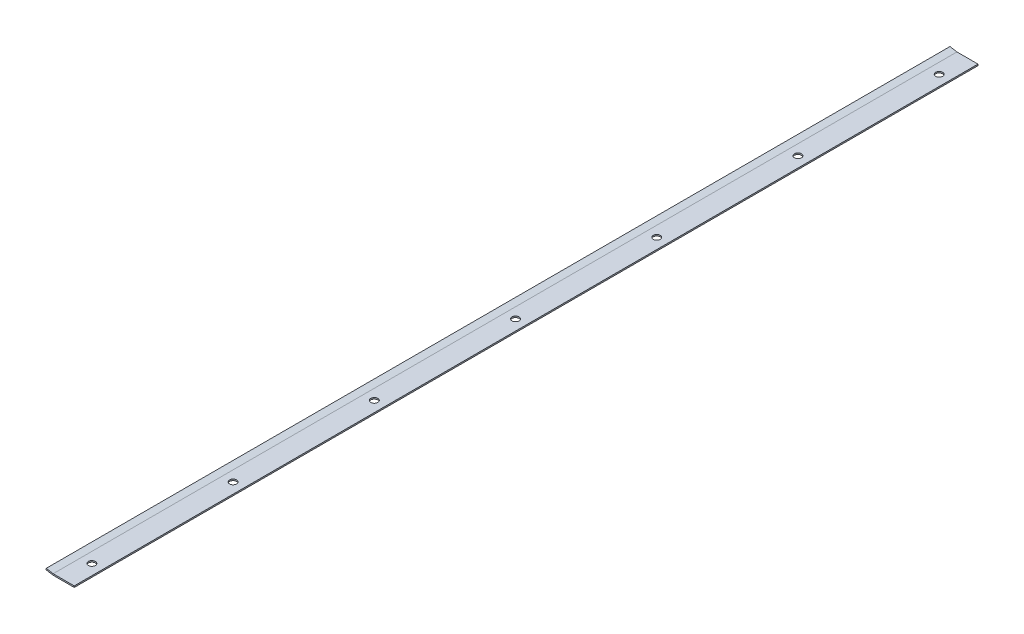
ISO-10303-21;
HEADER;
FILE_DESCRIPTION(('STEP AP214'),'2;1');
FILE_NAME('part.step','',(''),(''),'','','');
FILE_SCHEMA(('AUTOMOTIVE_DESIGN { 1 0 10303 214 1 1 1 1 }'));
ENDSEC;
DATA;
#1=APPLICATION_CONTEXT('core data for automotive mechanical design processes');
#2=APPLICATION_PROTOCOL_DEFINITION('international standard','automotive_design',2000,#1);
#3=PRODUCT_CONTEXT('',#1,'mechanical');
#4=PRODUCT('Part','Part','',(#3));
#5=PRODUCT_RELATED_PRODUCT_CATEGORY('part','',(#4));
#6=PRODUCT_DEFINITION_FORMATION('','',#4);
#7=PRODUCT_DEFINITION_CONTEXT('part definition',#1,'design');
#8=PRODUCT_DEFINITION('design','',#6,#7);
#9=PRODUCT_DEFINITION_SHAPE('','',#8);
#10=(LENGTH_UNIT() NAMED_UNIT(*) SI_UNIT(.MILLI.,.METRE.));
#11=(NAMED_UNIT(*) PLANE_ANGLE_UNIT() SI_UNIT($,.RADIAN.));
#12=(NAMED_UNIT(*) SI_UNIT($,.STERADIAN.) SOLID_ANGLE_UNIT());
#13=UNCERTAINTY_MEASURE_WITH_UNIT(LENGTH_MEASURE(1.E-05),#10,'distance_accuracy_value','');
#14=(GEOMETRIC_REPRESENTATION_CONTEXT(3) GLOBAL_UNCERTAINTY_ASSIGNED_CONTEXT((#13)) GLOBAL_UNIT_ASSIGNED_CONTEXT((#10,
#11,#12)) REPRESENTATION_CONTEXT('',''));
#15=CARTESIAN_POINT('',(0.,0.,0.));
#16=DIRECTION('',(0.,0.,1.));
#17=DIRECTION('',(1.,0.,0.));
#18=AXIS2_PLACEMENT_3D('',#15,#16,#17);
#19=CARTESIAN_POINT('',(0.,0.,320.));
#20=DIRECTION('',(0.,-1.,0.));
#21=DIRECTION('',(0.,0.,-1.));
#22=AXIS2_PLACEMENT_3D('',#19,#20,#21);
#23=PLANE('',#22);
#24=CARTESIAN_POINT('',(-7.50000000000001,0.,300.));
#25=DIRECTION('',(0.,-1.,0.));
#26=DIRECTION('',(0.,0.,-1.));
#27=AXIS2_PLACEMENT_3D('',#24,#25,#26);
#28=CIRCLE('',#27,2.5);
#29=CARTESIAN_POINT('',(-7.50000000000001,0.,297.5));
#30=VERTEX_POINT('',#29);
#31=EDGE_CURVE('E122',#30,#30,#28,.T.);
#32=ORIENTED_EDGE('',*,*,#31,.F.);
#33=EDGE_LOOP('',(#32));
#34=FACE_BOUND('',#33,.T.);
#35=DIRECTION('',(-1.,0.,0.));
#36=VECTOR('',#35,1.);
#37=CARTESIAN_POINT('',(0.,0.,-320.));
#38=LINE('',#37,#36);
#39=CARTESIAN_POINT('',(0.,0.,-320.));
#40=VERTEX_POINT('',#39);
#41=CARTESIAN_POINT('',(-15.,0.,-320.));
#42=VERTEX_POINT('',#41);
#43=EDGE_CURVE('E132',#40,#42,#38,.T.);
#44=ORIENTED_EDGE('',*,*,#43,.F.);
#45=DIRECTION('',(0.,0.,-1.));
#46=VECTOR('',#45,1.);
#47=CARTESIAN_POINT('',(0.,0.,320.));
#48=LINE('',#47,#46);
#49=CARTESIAN_POINT('',(0.,0.,320.));
#50=VERTEX_POINT('',#49);
#51=EDGE_CURVE('E167',#50,#40,#48,.T.);
#52=ORIENTED_EDGE('',*,*,#51,.F.);
#53=DIRECTION('',(-1.,0.,0.));
#54=VECTOR('',#53,1.);
#55=CARTESIAN_POINT('',(0.,0.,320.));
#56=LINE('',#55,#54);
#57=CARTESIAN_POINT('',(-15.,0.,320.));
#58=VERTEX_POINT('',#57);
#59=EDGE_CURVE('E154',#50,#58,#56,.T.);
#60=ORIENTED_EDGE('',*,*,#59,.T.);
#61=DIRECTION('',(0.,0.,-1.));
#62=VECTOR('',#61,1.);
#63=CARTESIAN_POINT('',(-15.,0.,320.));
#64=LINE('',#63,#62);
#65=EDGE_CURVE('E170',#58,#42,#64,.T.);
#66=ORIENTED_EDGE('',*,*,#65,.T.);
#67=EDGE_LOOP('',(#44,#52,#60,#66));
#68=FACE_BOUND('',#67,.T.);
#69=CARTESIAN_POINT('',(-7.50000000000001,0.,200.));
#70=DIRECTION('',(0.,-1.,0.));
#71=DIRECTION('',(0.,0.,-1.));
#72=AXIS2_PLACEMENT_3D('',#69,#70,#71);
#73=CIRCLE('',#72,2.5);
#74=CARTESIAN_POINT('',(-7.50000000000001,0.,197.5));
#75=VERTEX_POINT('',#74);
#76=EDGE_CURVE('E380',#75,#75,#73,.T.);
#77=ORIENTED_EDGE('',*,*,#76,.F.);
#78=EDGE_LOOP('',(#77));
#79=FACE_BOUND('',#78,.T.);
#80=CARTESIAN_POINT('',(-7.50000000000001,0.,100.));
#81=DIRECTION('',(0.,-1.,0.));
#82=DIRECTION('',(0.,0.,-1.));
#83=AXIS2_PLACEMENT_3D('',#80,#81,#82);
#84=CIRCLE('',#83,2.5);
#85=CARTESIAN_POINT('',(-7.50000000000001,0.,97.5000000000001));
#86=VERTEX_POINT('',#85);
#87=EDGE_CURVE('E111',#86,#86,#84,.T.);
#88=ORIENTED_EDGE('',*,*,#87,.F.);
#89=EDGE_LOOP('',(#88));
#90=FACE_BOUND('',#89,.T.);
#91=CARTESIAN_POINT('',(-7.50000000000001,0.,0.));
#92=DIRECTION('',(0.,-1.,0.));
#93=DIRECTION('',(0.,0.,-1.));
#94=AXIS2_PLACEMENT_3D('',#91,#92,#93);
#95=CIRCLE('',#94,2.5);
#96=CARTESIAN_POINT('',(-7.50000000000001,0.,-2.50000000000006));
#97=VERTEX_POINT('',#96);
#98=EDGE_CURVE('E182',#97,#97,#95,.T.);
#99=ORIENTED_EDGE('',*,*,#98,.F.);
#100=EDGE_LOOP('',(#99));
#101=FACE_BOUND('',#100,.T.);
#102=CARTESIAN_POINT('',(-7.50000000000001,0.,-100.));
#103=DIRECTION('',(0.,-1.,0.));
#104=DIRECTION('',(0.,0.,-1.));
#105=AXIS2_PLACEMENT_3D('',#102,#103,#104);
#106=CIRCLE('',#105,2.5);
#107=CARTESIAN_POINT('',(-7.50000000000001,0.,-102.5));
#108=VERTEX_POINT('',#107);
#109=EDGE_CURVE('E190',#108,#108,#106,.T.);
#110=ORIENTED_EDGE('',*,*,#109,.F.);
#111=EDGE_LOOP('',(#110));
#112=FACE_BOUND('',#111,.T.);
#113=CARTESIAN_POINT('',(-7.50000000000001,0.,-200.));
#114=DIRECTION('',(0.,-1.,0.));
#115=DIRECTION('',(0.,0.,-1.));
#116=AXIS2_PLACEMENT_3D('',#113,#114,#115);
#117=CIRCLE('',#116,2.5);
#118=CARTESIAN_POINT('',(-7.50000000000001,0.,-202.5));
#119=VERTEX_POINT('',#118);
#120=EDGE_CURVE('E198',#119,#119,#117,.T.);
#121=ORIENTED_EDGE('',*,*,#120,.F.);
#122=EDGE_LOOP('',(#121));
#123=FACE_BOUND('',#122,.T.);
#124=CARTESIAN_POINT('',(-7.50000000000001,0.,-300.));
#125=DIRECTION('',(0.,-1.,0.));
#126=DIRECTION('',(0.,0.,-1.));
#127=AXIS2_PLACEMENT_3D('',#124,#125,#126);
#128=CIRCLE('',#127,2.5);
#129=CARTESIAN_POINT('',(-7.50000000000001,0.,-302.5));
#130=VERTEX_POINT('',#129);
#131=EDGE_CURVE('E53',#130,#130,#128,.T.);
#132=ORIENTED_EDGE('',*,*,#131,.F.);
#133=EDGE_LOOP('',(#132));
#134=FACE_BOUND('',#133,.T.);
#135=ADVANCED_FACE('F44',(#34,#68,#79,#90,#101,#112,#123,#134),#23,.T.);
#136=CARTESIAN_POINT('',(0.,1.00000000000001,320.));
#137=DIRECTION('',(0.,-1.,0.));
#138=DIRECTION('',(0.,0.,-1.));
#139=AXIS2_PLACEMENT_3D('',#136,#137,#138);
#140=PLANE('',#139);
#141=CARTESIAN_POINT('',(-7.50000000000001,1.00000000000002,300.));
#142=DIRECTION('',(0.,-1.,0.));
#143=DIRECTION('',(0.,0.,-1.));
#144=AXIS2_PLACEMENT_3D('',#141,#142,#143);
#145=CIRCLE('',#144,2.5);
#146=CARTESIAN_POINT('',(-7.50000000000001,1.00000000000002,297.5));
#147=VERTEX_POINT('',#146);
#148=EDGE_CURVE('E400',#147,#147,#145,.T.);
#149=ORIENTED_EDGE('',*,*,#148,.T.);
#150=EDGE_LOOP('',(#149));
#151=FACE_BOUND('',#150,.T.);
#152=DIRECTION('',(-1.,0.,0.));
#153=VECTOR('',#152,1.);
#154=CARTESIAN_POINT('',(0.,1.,-320.));
#155=LINE('',#154,#153);
#156=CARTESIAN_POINT('',(0.,1.,-320.));
#157=VERTEX_POINT('',#156);
#158=CARTESIAN_POINT('',(-14.9125113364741,1.,-320.));
#159=VERTEX_POINT('',#158);
#160=EDGE_CURVE('E142',#157,#159,#155,.T.);
#161=ORIENTED_EDGE('',*,*,#160,.T.);
#162=DIRECTION('',(0.,0.,-1.));
#163=VECTOR('',#162,1.);
#164=CARTESIAN_POINT('',(-14.9125113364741,1.00000000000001,320.));
#165=LINE('',#164,#163);
#166=CARTESIAN_POINT('',(-14.9125113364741,1.00000000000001,320.));
#167=VERTEX_POINT('',#166);
#168=EDGE_CURVE('E118',#167,#159,#165,.T.);
#169=ORIENTED_EDGE('',*,*,#168,.F.);
#170=DIRECTION('',(-1.,0.,0.));
#171=VECTOR('',#170,1.);
#172=CARTESIAN_POINT('',(0.,1.00000000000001,320.));
#173=LINE('',#172,#171);
#174=CARTESIAN_POINT('',(0.,1.00000000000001,320.));
#175=VERTEX_POINT('',#174);
#176=EDGE_CURVE('E60',#175,#167,#173,.T.);
#177=ORIENTED_EDGE('',*,*,#176,.F.);
#178=DIRECTION('',(0.,0.,-1.));
#179=VECTOR('',#178,1.);
#180=CARTESIAN_POINT('',(0.,1.00000000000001,320.));
#181=LINE('',#180,#179);
#182=EDGE_CURVE('E68',#175,#157,#181,.T.);
#183=ORIENTED_EDGE('',*,*,#182,.T.);
#184=EDGE_LOOP('',(#161,#169,#177,#183));
#185=FACE_BOUND('',#184,.T.);
#186=CARTESIAN_POINT('',(-7.50000000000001,1.,200.));
#187=DIRECTION('',(0.,-1.,0.));
#188=DIRECTION('',(0.,0.,-1.));
#189=AXIS2_PLACEMENT_3D('',#186,#187,#188);
#190=CIRCLE('',#189,2.5);
#191=CARTESIAN_POINT('',(-7.50000000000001,1.,197.5));
#192=VERTEX_POINT('',#191);
#193=EDGE_CURVE('E396',#192,#192,#190,.T.);
#194=ORIENTED_EDGE('',*,*,#193,.T.);
#195=EDGE_LOOP('',(#194));
#196=FACE_BOUND('',#195,.T.);
#197=CARTESIAN_POINT('',(-7.50000000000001,1.,99.9999999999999));
#198=DIRECTION('',(0.,-1.,0.));
#199=DIRECTION('',(0.,0.,-1.));
#200=AXIS2_PLACEMENT_3D('',#197,#198,#199);
#201=CIRCLE('',#200,2.5);
#202=CARTESIAN_POINT('',(-7.50000000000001,1.,97.4999999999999));
#203=VERTEX_POINT('',#202);
#204=EDGE_CURVE('E178',#203,#203,#201,.T.);
#205=ORIENTED_EDGE('',*,*,#204,.T.);
#206=EDGE_LOOP('',(#205));
#207=FACE_BOUND('',#206,.T.);
#208=CARTESIAN_POINT('',(-7.50000000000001,1.,0.));
#209=DIRECTION('',(0.,-1.,0.));
#210=DIRECTION('',(0.,0.,-1.));
#211=AXIS2_PLACEMENT_3D('',#208,#209,#210);
#212=CIRCLE('',#211,2.5);
#213=CARTESIAN_POINT('',(-7.50000000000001,1.,-2.50000000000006));
#214=VERTEX_POINT('',#213);
#215=EDGE_CURVE('E186',#214,#214,#212,.T.);
#216=ORIENTED_EDGE('',*,*,#215,.T.);
#217=EDGE_LOOP('',(#216));
#218=FACE_BOUND('',#217,.T.);
#219=CARTESIAN_POINT('',(-7.50000000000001,1.,-100.));
#220=DIRECTION('',(0.,-1.,0.));
#221=DIRECTION('',(0.,0.,-1.));
#222=AXIS2_PLACEMENT_3D('',#219,#220,#221);
#223=CIRCLE('',#222,2.5);
#224=CARTESIAN_POINT('',(-7.50000000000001,1.,-102.5));
#225=VERTEX_POINT('',#224);
#226=EDGE_CURVE('E194',#225,#225,#223,.T.);
#227=ORIENTED_EDGE('',*,*,#226,.T.);
#228=EDGE_LOOP('',(#227));
#229=FACE_BOUND('',#228,.T.);
#230=CARTESIAN_POINT('',(-7.50000000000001,1.00000000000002,-200.));
#231=DIRECTION('',(0.,-1.,0.));
#232=DIRECTION('',(0.,0.,-1.));
#233=AXIS2_PLACEMENT_3D('',#230,#231,#232);
#234=CIRCLE('',#233,2.5);
#235=CARTESIAN_POINT('',(-7.50000000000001,1.00000000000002,-202.5));
#236=VERTEX_POINT('',#235);
#237=EDGE_CURVE('E201',#236,#236,#234,.T.);
#238=ORIENTED_EDGE('',*,*,#237,.T.);
#239=EDGE_LOOP('',(#238));
#240=FACE_BOUND('',#239,.T.);
#241=CARTESIAN_POINT('',(-7.50000000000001,1.,-300.));
#242=DIRECTION('',(0.,-1.,0.));
#243=DIRECTION('',(0.,0.,-1.));
#244=AXIS2_PLACEMENT_3D('',#241,#242,#243);
#245=CIRCLE('',#244,2.5);
#246=CARTESIAN_POINT('',(-7.50000000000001,1.,-302.5));
#247=VERTEX_POINT('',#246);
#248=EDGE_CURVE('E11',#247,#247,#245,.T.);
#249=ORIENTED_EDGE('',*,*,#248,.T.);
#250=EDGE_LOOP('',(#249));
#251=FACE_BOUND('',#250,.T.);
#252=ADVANCED_FACE('F211',(#151,#185,#196,#207,#218,#229,#240,#251),#140,.F.);
#253=CARTESIAN_POINT('',(-14.8263518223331,0.984807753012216,320.));
#254=DIRECTION('',(-0.173648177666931,-0.984807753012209,0.));
#255=DIRECTION('',(0.984807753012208,-0.173648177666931,0.));
#256=AXIS2_PLACEMENT_3D('',#253,#254,#255);
#257=PLANE('',#256);
#258=DIRECTION('',(-0.984807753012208,0.173648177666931,0.));
#259=VECTOR('',#258,1.);
#260=CARTESIAN_POINT('',(-14.8263518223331,0.984807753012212,-320.));
#261=LINE('',#260,#259);
#262=CARTESIAN_POINT('',(-19.8263518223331,1.86644265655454,-320.));
#263=VERTEX_POINT('',#262);
#264=EDGE_CURVE('E116',#159,#263,#261,.T.);
#265=ORIENTED_EDGE('',*,*,#264,.T.);
#266=DIRECTION('',(0.,0.,-1.));
#267=VECTOR('',#266,1.);
#268=CARTESIAN_POINT('',(-19.8263518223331,1.86644265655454,320.));
#269=LINE('',#268,#267);
#270=CARTESIAN_POINT('',(-19.8263518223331,1.86644265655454,320.));
#271=VERTEX_POINT('',#270);
#272=EDGE_CURVE('E100',#271,#263,#269,.T.);
#273=ORIENTED_EDGE('',*,*,#272,.F.);
#274=DIRECTION('',(-0.984807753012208,0.173648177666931,0.));
#275=VECTOR('',#274,1.);
#276=CARTESIAN_POINT('',(-14.8263518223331,0.984807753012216,320.));
#277=LINE('',#276,#275);
#278=EDGE_CURVE('E145',#167,#271,#277,.T.);
#279=ORIENTED_EDGE('',*,*,#278,.F.);
#280=ORIENTED_EDGE('',*,*,#168,.T.);
#281=EDGE_LOOP('',(#265,#273,#279,#280));
#282=FACE_BOUND('',#281,.T.);
#283=ADVANCED_FACE('F117',(#282),#257,.F.);
#284=CARTESIAN_POINT('',(-20.,0.881634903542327,320.));
#285=DIRECTION('',(-0.984807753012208,0.173648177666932,0.));
#286=DIRECTION('',(-0.173648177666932,-0.984807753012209,0.));
#287=AXIS2_PLACEMENT_3D('',#284,#285,#286);
#288=PLANE('',#287);
#289=DIRECTION('',(0.173648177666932,0.984807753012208,0.));
#290=VECTOR('',#289,1.);
#291=CARTESIAN_POINT('',(-20.,0.881634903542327,-320.));
#292=LINE('',#291,#290);
#293=CARTESIAN_POINT('',(-20.,0.881634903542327,-320.));
#294=VERTEX_POINT('',#293);
#295=EDGE_CURVE('E104',#294,#263,#292,.T.);
#296=ORIENTED_EDGE('',*,*,#295,.F.);
#297=DIRECTION('',(0.,0.,-1.));
#298=VECTOR('',#297,1.);
#299=CARTESIAN_POINT('',(-20.,0.881634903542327,320.));
#300=LINE('',#299,#298);
#301=CARTESIAN_POINT('',(-20.,0.881634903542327,320.));
#302=VERTEX_POINT('',#301);
#303=EDGE_CURVE('E112',#302,#294,#300,.T.);
#304=ORIENTED_EDGE('',*,*,#303,.F.);
#305=DIRECTION('',(0.173648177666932,0.984807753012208,0.));
#306=VECTOR('',#305,1.);
#307=CARTESIAN_POINT('',(-20.,0.881634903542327,320.));
#308=LINE('',#307,#306);
#309=EDGE_CURVE('E107',#302,#271,#308,.T.);
#310=ORIENTED_EDGE('',*,*,#309,.T.);
#311=ORIENTED_EDGE('',*,*,#272,.T.);
#312=EDGE_LOOP('',(#296,#304,#310,#311));
#313=FACE_BOUND('',#312,.T.);
#314=ADVANCED_FACE('F102',(#313),#288,.T.);
#315=CARTESIAN_POINT('',(-15.,0.,320.));
#316=DIRECTION('',(-0.173648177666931,-0.984807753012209,0.));
#317=DIRECTION('',(0.984807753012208,-0.173648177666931,0.));
#318=AXIS2_PLACEMENT_3D('',#315,#316,#317);
#319=PLANE('',#318);
#320=DIRECTION('',(-0.984807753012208,0.173648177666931,0.));
#321=VECTOR('',#320,1.);
#322=CARTESIAN_POINT('',(-15.,0.,-320.));
#323=LINE('',#322,#321);
#324=EDGE_CURVE('E127',#42,#294,#323,.T.);
#325=ORIENTED_EDGE('',*,*,#324,.F.);
#326=ORIENTED_EDGE('',*,*,#65,.F.);
#327=DIRECTION('',(-0.984807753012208,0.173648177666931,0.));
#328=VECTOR('',#327,1.);
#329=CARTESIAN_POINT('',(-15.,0.,320.));
#330=LINE('',#329,#328);
#331=EDGE_CURVE('E150',#58,#302,#330,.T.);
#332=ORIENTED_EDGE('',*,*,#331,.T.);
#333=ORIENTED_EDGE('',*,*,#303,.T.);
#334=EDGE_LOOP('',(#325,#326,#332,#333));
#335=FACE_BOUND('',#334,.T.);
#336=ADVANCED_FACE('F224',(#335),#319,.T.);
#337=CARTESIAN_POINT('',(0.,1.00000000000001,320.));
#338=DIRECTION('',(1.,0.,0.));
#339=DIRECTION('',(0.,0.,-1.));
#340=AXIS2_PLACEMENT_3D('',#337,#338,#339);
#341=PLANE('',#340);
#342=DIRECTION('',(0.,-1.,0.));
#343=VECTOR('',#342,1.);
#344=CARTESIAN_POINT('',(0.,1.,-320.));
#345=LINE('',#344,#343);
#346=EDGE_CURVE('E138',#157,#40,#345,.T.);
#347=ORIENTED_EDGE('',*,*,#346,.F.);
#348=ORIENTED_EDGE('',*,*,#182,.F.);
#349=DIRECTION('',(0.,-1.,0.));
#350=VECTOR('',#349,1.);
#351=CARTESIAN_POINT('',(0.,1.00000000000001,320.));
#352=LINE('',#351,#350);
#353=EDGE_CURVE('E158',#175,#50,#352,.T.);
#354=ORIENTED_EDGE('',*,*,#353,.T.);
#355=ORIENTED_EDGE('',*,*,#51,.T.);
#356=EDGE_LOOP('',(#347,#348,#354,#355));
#357=FACE_BOUND('',#356,.T.);
#358=ADVANCED_FACE('F223',(#357),#341,.T.);
#359=CARTESIAN_POINT('',(-19.8263518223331,1.86644265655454,320.));
#360=DIRECTION('',(0.,0.,-1.));
#361=DIRECTION('',(-1.,0.,0.));
#362=AXIS2_PLACEMENT_3D('',#359,#360,#361);
#363=PLANE('',#362);
#364=ORIENTED_EDGE('',*,*,#278,.T.);
#365=ORIENTED_EDGE('',*,*,#309,.F.);
#366=ORIENTED_EDGE('',*,*,#331,.F.);
#367=ORIENTED_EDGE('',*,*,#59,.F.);
#368=ORIENTED_EDGE('',*,*,#353,.F.);
#369=ORIENTED_EDGE('',*,*,#176,.T.);
#370=EDGE_LOOP('',(#364,#365,#366,#367,#368,#369));
#371=FACE_BOUND('',#370,.T.);
#372=ADVANCED_FACE('F301',(#371),#363,.F.);
#373=CARTESIAN_POINT('',(-19.8263518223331,1.86644265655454,-320.));
#374=DIRECTION('',(0.,0.,-1.));
#375=DIRECTION('',(-1.,0.,0.));
#376=AXIS2_PLACEMENT_3D('',#373,#374,#375);
#377=PLANE('',#376);
#378=ORIENTED_EDGE('',*,*,#264,.F.);
#379=ORIENTED_EDGE('',*,*,#160,.F.);
#380=ORIENTED_EDGE('',*,*,#346,.T.);
#381=ORIENTED_EDGE('',*,*,#43,.T.);
#382=ORIENTED_EDGE('',*,*,#324,.T.);
#383=ORIENTED_EDGE('',*,*,#295,.T.);
#384=EDGE_LOOP('',(#378,#379,#380,#381,#382,#383));
#385=FACE_BOUND('',#384,.T.);
#386=ADVANCED_FACE('F124',(#385),#377,.T.);
#387=CARTESIAN_POINT('',(-7.50000000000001,-0.000999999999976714,300.));
#388=DIRECTION('',(0.,1.,0.));
#389=DIRECTION('',(0.,0.,1.));
#390=AXIS2_PLACEMENT_3D('',#387,#388,#389);
#391=CYLINDRICAL_SURFACE('',#390,2.5);
#392=ORIENTED_EDGE('',*,*,#31,.T.);
#393=EDGE_LOOP('',(#392));
#394=FACE_BOUND('',#393,.T.);
#395=ORIENTED_EDGE('',*,*,#148,.F.);
#396=EDGE_LOOP('',(#395));
#397=FACE_BOUND('',#396,.T.);
#398=ADVANCED_FACE('F284',(#394,#397),#391,.F.);
#399=CARTESIAN_POINT('',(-7.50000000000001,-0.000999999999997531,200.));
#400=DIRECTION('',(0.,1.,0.));
#401=DIRECTION('',(0.,0.,1.));
#402=AXIS2_PLACEMENT_3D('',#399,#400,#401);
#403=CYLINDRICAL_SURFACE('',#402,2.5);
#404=ORIENTED_EDGE('',*,*,#76,.T.);
#405=EDGE_LOOP('',(#404));
#406=FACE_BOUND('',#405,.T.);
#407=ORIENTED_EDGE('',*,*,#193,.F.);
#408=EDGE_LOOP('',(#407));
#409=FACE_BOUND('',#408,.T.);
#410=ADVANCED_FACE('F236',(#406,#409),#403,.F.);
#411=CARTESIAN_POINT('',(-7.50000000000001,-0.001000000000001,100.));
#412=DIRECTION('',(0.,1.,0.));
#413=DIRECTION('',(0.,0.,1.));
#414=AXIS2_PLACEMENT_3D('',#411,#412,#413);
#415=CYLINDRICAL_SURFACE('',#414,2.5);
#416=ORIENTED_EDGE('',*,*,#87,.T.);
#417=EDGE_LOOP('',(#416));
#418=FACE_BOUND('',#417,.T.);
#419=ORIENTED_EDGE('',*,*,#204,.F.);
#420=EDGE_LOOP('',(#419));
#421=FACE_BOUND('',#420,.T.);
#422=ADVANCED_FACE('F232',(#418,#421),#415,.F.);
#423=CARTESIAN_POINT('',(-7.50000000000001,-0.000999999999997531,0.));
#424=DIRECTION('',(0.,1.,0.));
#425=DIRECTION('',(0.,0.,1.));
#426=AXIS2_PLACEMENT_3D('',#423,#424,#425);
#427=CYLINDRICAL_SURFACE('',#426,2.5);
#428=ORIENTED_EDGE('',*,*,#98,.T.);
#429=EDGE_LOOP('',(#428));
#430=FACE_BOUND('',#429,.T.);
#431=ORIENTED_EDGE('',*,*,#215,.F.);
#432=EDGE_LOOP('',(#431));
#433=FACE_BOUND('',#432,.T.);
#434=ADVANCED_FACE('F235',(#430,#433),#427,.F.);
#435=CARTESIAN_POINT('',(-7.50000000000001,-0.001000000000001,-100.));
#436=DIRECTION('',(0.,1.,0.));
#437=DIRECTION('',(0.,0.,1.));
#438=AXIS2_PLACEMENT_3D('',#435,#436,#437);
#439=CYLINDRICAL_SURFACE('',#438,2.5);
#440=ORIENTED_EDGE('',*,*,#109,.T.);
#441=EDGE_LOOP('',(#440));
#442=FACE_BOUND('',#441,.T.);
#443=ORIENTED_EDGE('',*,*,#226,.F.);
#444=EDGE_LOOP('',(#443));
#445=FACE_BOUND('',#444,.T.);
#446=ADVANCED_FACE('F240',(#442,#445),#439,.F.);
#447=CARTESIAN_POINT('',(-7.50000000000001,-0.000999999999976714,-200.));
#448=DIRECTION('',(0.,1.,0.));
#449=DIRECTION('',(0.,0.,1.));
#450=AXIS2_PLACEMENT_3D('',#447,#448,#449);
#451=CYLINDRICAL_SURFACE('',#450,2.5);
#452=ORIENTED_EDGE('',*,*,#120,.T.);
#453=EDGE_LOOP('',(#452));
#454=FACE_BOUND('',#453,.T.);
#455=ORIENTED_EDGE('',*,*,#237,.F.);
#456=EDGE_LOOP('',(#455));
#457=FACE_BOUND('',#456,.T.);
#458=ADVANCED_FACE('F243',(#454,#457),#451,.F.);
#459=CARTESIAN_POINT('',(-7.50000000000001,-0.000999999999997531,-300.));
#460=DIRECTION('',(0.,1.,0.));
#461=DIRECTION('',(0.,0.,1.));
#462=AXIS2_PLACEMENT_3D('',#459,#460,#461);
#463=CYLINDRICAL_SURFACE('',#462,2.5);
#464=ORIENTED_EDGE('',*,*,#131,.T.);
#465=EDGE_LOOP('',(#464));
#466=FACE_BOUND('',#465,.T.);
#467=ORIENTED_EDGE('',*,*,#248,.F.);
#468=EDGE_LOOP('',(#467));
#469=FACE_BOUND('',#468,.T.);
#470=ADVANCED_FACE('F46',(#466,#469),#463,.F.);
#471=CLOSED_SHELL('',(#135,#252,#283,#314,#336,#358,#372,#386,#398,#410,#422,#434,#446,#458,#470));
#472=MANIFOLD_SOLID_BREP('B2',#471);
#473=ADVANCED_BREP_SHAPE_REPRESENTATION('',(#18,#472),#14);
#474=SHAPE_DEFINITION_REPRESENTATION(#9,#473);
ENDSEC;
END-ISO-10303-21;
